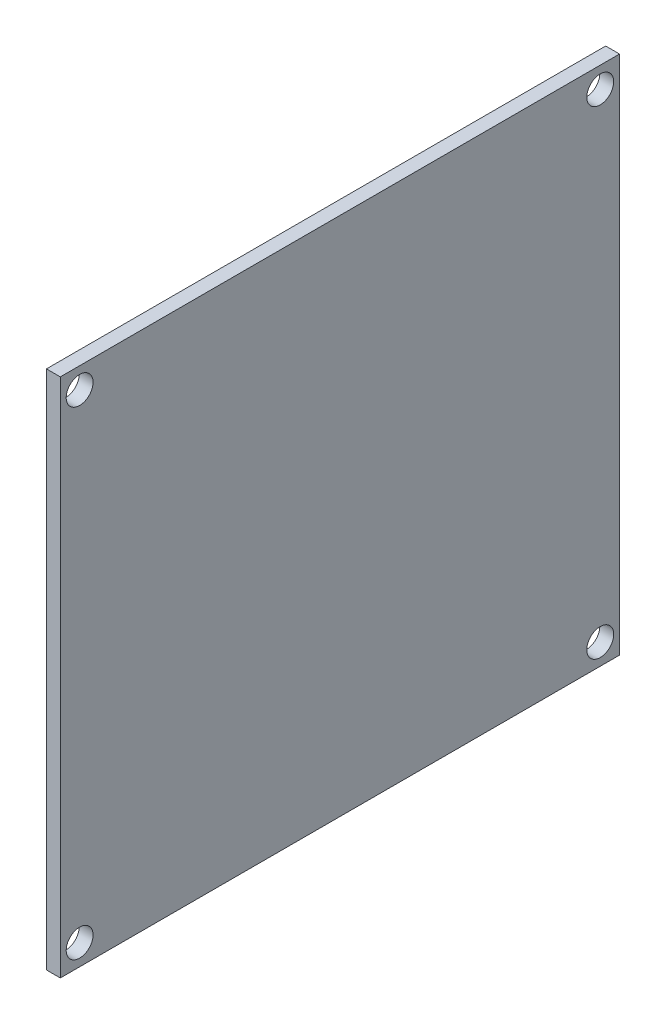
from build123d import *

# Parameters (mm, degrees)
ESQUISSE1_W        = 66.6
ESQUISSE1_H        = 62
ESQUISSE1_R        = 1.6
BOSS_EXTRU_1_DEPTH = 1.65


with BuildPart() as part:
    # Esquisse1 → Boss.-Extru.1 (new body)
    with BuildSketch(Plane(origin=(0, 0, 0), x_dir=(0, 0, -1), z_dir=(1, 0, 0))):
        Rectangle(ESQUISSE1_W, ESQUISSE1_H)
        with Locations((-31, 28.5)):
            Circle(ESQUISSE1_R, mode=Mode.SUBTRACT)
        with Locations(Location((31, 28.5, 0), (0, 0, 180))):
            Circle(ESQUISSE1_R, mode=Mode.SUBTRACT)
        with Locations((31, -28.5)):
            Circle(ESQUISSE1_R, mode=Mode.SUBTRACT)
        with Locations(Location((-31, -28.5, 0), (0, 0, 180))):
            Circle(ESQUISSE1_R, mode=Mode.SUBTRACT)
    extrude(amount=BOSS_EXTRU_1_DEPTH)


solid = part.part
